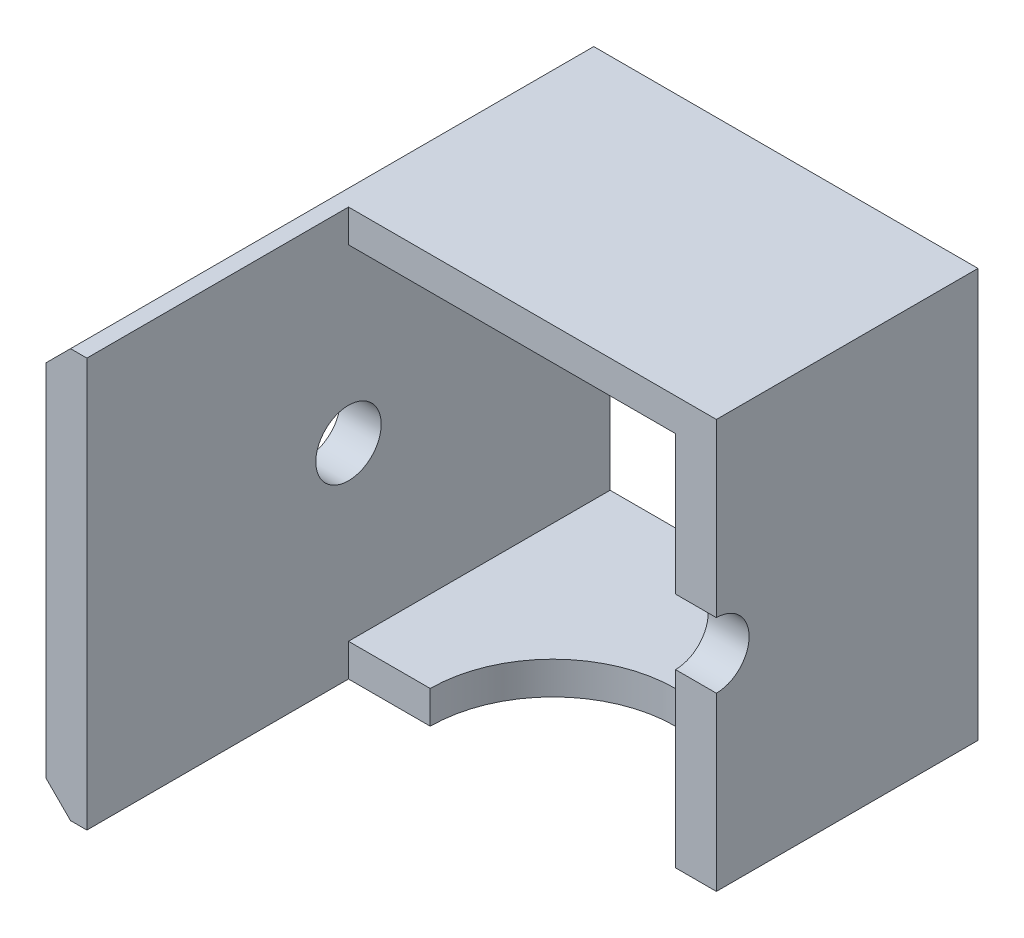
ISO-10303-21;
HEADER;
FILE_DESCRIPTION(('STEP AP214'),'2;1');
FILE_NAME('part.step','',(''),(''),'','','');
FILE_SCHEMA(('AUTOMOTIVE_DESIGN { 1 0 10303 214 1 1 1 1 }'));
ENDSEC;
DATA;
#1=APPLICATION_CONTEXT('core data for automotive mechanical design processes');
#2=APPLICATION_PROTOCOL_DEFINITION('international standard','automotive_design',2000,#1);
#3=PRODUCT_CONTEXT('',#1,'mechanical');
#4=PRODUCT('Part','Part','',(#3));
#5=PRODUCT_RELATED_PRODUCT_CATEGORY('part','',(#4));
#6=PRODUCT_DEFINITION_FORMATION('','',#4);
#7=PRODUCT_DEFINITION_CONTEXT('part definition',#1,'design');
#8=PRODUCT_DEFINITION('design','',#6,#7);
#9=PRODUCT_DEFINITION_SHAPE('','',#8);
#10=(LENGTH_UNIT() NAMED_UNIT(*) SI_UNIT(.MILLI.,.METRE.));
#11=(NAMED_UNIT(*) PLANE_ANGLE_UNIT() SI_UNIT($,.RADIAN.));
#12=(NAMED_UNIT(*) SI_UNIT($,.STERADIAN.) SOLID_ANGLE_UNIT());
#13=UNCERTAINTY_MEASURE_WITH_UNIT(LENGTH_MEASURE(1.E-05),#10,'distance_accuracy_value','');
#14=(GEOMETRIC_REPRESENTATION_CONTEXT(3) GLOBAL_UNCERTAINTY_ASSIGNED_CONTEXT((#13)) GLOBAL_UNIT_ASSIGNED_CONTEXT((#10,
#11,#12)) REPRESENTATION_CONTEXT('',''));
#15=CARTESIAN_POINT('',(0.,0.,0.));
#16=DIRECTION('',(0.,0.,1.));
#17=DIRECTION('',(1.,0.,0.));
#18=AXIS2_PLACEMENT_3D('',#15,#16,#17);
#19=CARTESIAN_POINT('',(-15.,12.5,16.));
#20=DIRECTION('',(0.,0.,1.));
#21=DIRECTION('',(1.,0.,0.));
#22=AXIS2_PLACEMENT_3D('',#19,#20,#21);
#23=PLANE('',#22);
#24=DIRECTION('',(0.,-1.,0.));
#25=VECTOR('',#24,1.);
#26=CARTESIAN_POINT('',(-12.5,10.5,16.));
#27=LINE('',#26,#25);
#28=CARTESIAN_POINT('',(-12.5,12.5,16.));
#29=VERTEX_POINT('',#28);
#30=CARTESIAN_POINT('',(-12.5,-12.5,16.));
#31=VERTEX_POINT('',#30);
#32=EDGE_CURVE('E225',#29,#31,#27,.T.);
#33=ORIENTED_EDGE('',*,*,#32,.F.);
#34=DIRECTION('',(-1.,0.,0.));
#35=VECTOR('',#34,1.);
#36=CARTESIAN_POINT('',(-15.,12.5,16.));
#37=LINE('',#36,#35);
#38=CARTESIAN_POINT('',(-13.5,12.5,16.));
#39=VERTEX_POINT('',#38);
#40=EDGE_CURVE('E170',#29,#39,#37,.T.);
#41=ORIENTED_EDGE('',*,*,#40,.T.);
#42=DIRECTION('',(0.707106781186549,0.707106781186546,0.));
#43=VECTOR('',#42,1.);
#44=CARTESIAN_POINT('',(-14.25,11.75,16.));
#45=LINE('',#44,#43);
#46=CARTESIAN_POINT('',(-15.,11.,16.));
#47=VERTEX_POINT('',#46);
#48=EDGE_CURVE('E193',#39,#47,#45,.F.);
#49=ORIENTED_EDGE('',*,*,#48,.T.);
#50=DIRECTION('',(0.,-1.,0.));
#51=VECTOR('',#50,1.);
#52=CARTESIAN_POINT('',(-15.,12.5,16.));
#53=LINE('',#52,#51);
#54=CARTESIAN_POINT('',(-15.,-11.,16.));
#55=VERTEX_POINT('',#54);
#56=EDGE_CURVE('E247',#47,#55,#53,.T.);
#57=ORIENTED_EDGE('',*,*,#56,.T.);
#58=DIRECTION('',(-0.707106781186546,0.707106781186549,0.));
#59=VECTOR('',#58,1.);
#60=CARTESIAN_POINT('',(-26.75,0.750000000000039,16.));
#61=LINE('',#60,#59);
#62=CARTESIAN_POINT('',(-13.5,-12.5,16.));
#63=VERTEX_POINT('',#62);
#64=EDGE_CURVE('E191',#55,#63,#61,.F.);
#65=ORIENTED_EDGE('',*,*,#64,.T.);
#66=DIRECTION('',(1.,0.,0.));
#67=VECTOR('',#66,1.);
#68=CARTESIAN_POINT('',(-15.,-12.5,16.));
#69=LINE('',#68,#67);
#70=EDGE_CURVE('E174',#63,#31,#69,.T.);
#71=ORIENTED_EDGE('',*,*,#70,.T.);
#72=EDGE_LOOP('',(#33,#41,#49,#57,#65,#71));
#73=FACE_BOUND('',#72,.T.);
#74=ADVANCED_FACE('F35',(#73),#23,.T.);
#75=CARTESIAN_POINT('',(-15.,12.5,-16.));
#76=DIRECTION('',(0.,0.,1.));
#77=DIRECTION('',(1.,0.,0.));
#78=AXIS2_PLACEMENT_3D('',#75,#76,#77);
#79=PLANE('',#78);
#80=DIRECTION('',(0.,-1.,0.));
#81=VECTOR('',#80,1.);
#82=CARTESIAN_POINT('',(-15.,12.5,-16.));
#83=LINE('',#82,#81);
#84=CARTESIAN_POINT('',(-15.,11.,-16.));
#85=VERTEX_POINT('',#84);
#86=CARTESIAN_POINT('',(-15.,-11.,-16.));
#87=VERTEX_POINT('',#86);
#88=EDGE_CURVE('E246',#85,#87,#83,.T.);
#89=ORIENTED_EDGE('',*,*,#88,.F.);
#90=DIRECTION('',(-0.707106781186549,-0.707106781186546,0.));
#91=VECTOR('',#90,1.);
#92=CARTESIAN_POINT('',(-15.,11.,-16.));
#93=LINE('',#92,#91);
#94=CARTESIAN_POINT('',(-13.5,12.5,-16.));
#95=VERTEX_POINT('',#94);
#96=EDGE_CURVE('E186',#85,#95,#93,.F.);
#97=ORIENTED_EDGE('',*,*,#96,.T.);
#98=DIRECTION('',(-1.,0.,0.));
#99=VECTOR('',#98,1.);
#100=CARTESIAN_POINT('',(-15.,12.5,-16.));
#101=LINE('',#100,#99);
#102=CARTESIAN_POINT('',(10.,12.5,-16.));
#103=VERTEX_POINT('',#102);
#104=EDGE_CURVE('E177',#103,#95,#101,.T.);
#105=ORIENTED_EDGE('',*,*,#104,.F.);
#106=DIRECTION('',(0.,1.,0.));
#107=VECTOR('',#106,1.);
#108=CARTESIAN_POINT('',(10.,12.5,-16.));
#109=LINE('',#108,#107);
#110=CARTESIAN_POINT('',(10.,-12.5,-16.));
#111=VERTEX_POINT('',#110);
#112=EDGE_CURVE('E167',#111,#103,#109,.T.);
#113=ORIENTED_EDGE('',*,*,#112,.F.);
#114=DIRECTION('',(1.,0.,0.));
#115=VECTOR('',#114,1.);
#116=CARTESIAN_POINT('',(-15.,-12.5,-16.));
#117=LINE('',#116,#115);
#118=CARTESIAN_POINT('',(-13.5,-12.5,-16.));
#119=VERTEX_POINT('',#118);
#120=EDGE_CURVE('E254',#119,#111,#117,.T.);
#121=ORIENTED_EDGE('',*,*,#120,.F.);
#122=DIRECTION('',(0.707106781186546,-0.707106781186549,0.));
#123=VECTOR('',#122,1.);
#124=CARTESIAN_POINT('',(-13.5,-12.5,-16.));
#125=LINE('',#124,#123);
#126=EDGE_CURVE('E184',#119,#87,#125,.F.);
#127=ORIENTED_EDGE('',*,*,#126,.T.);
#128=EDGE_LOOP('',(#89,#97,#105,#113,#121,#127));
#129=FACE_BOUND('',#128,.T.);
#130=DIRECTION('',(0.,-1.,0.));
#131=VECTOR('',#130,1.);
#132=CARTESIAN_POINT('',(-12.5,10.5,-16.));
#133=LINE('',#132,#131);
#134=CARTESIAN_POINT('',(-12.5,10.5,-16.));
#135=VERTEX_POINT('',#134);
#136=CARTESIAN_POINT('',(-12.5,-10.5,-16.));
#137=VERTEX_POINT('',#136);
#138=EDGE_CURVE('E224',#135,#137,#133,.T.);
#139=ORIENTED_EDGE('',*,*,#138,.T.);
#140=DIRECTION('',(1.,0.,0.));
#141=VECTOR('',#140,1.);
#142=CARTESIAN_POINT('',(-12.5,-10.5,-16.));
#143=LINE('',#142,#141);
#144=CARTESIAN_POINT('',(7.5,-10.5,-16.));
#145=VERTEX_POINT('',#144);
#146=EDGE_CURVE('E231',#137,#145,#143,.T.);
#147=ORIENTED_EDGE('',*,*,#146,.T.);
#148=DIRECTION('',(0.,1.,0.));
#149=VECTOR('',#148,1.);
#150=CARTESIAN_POINT('',(7.5,10.5,-16.));
#151=LINE('',#150,#149);
#152=CARTESIAN_POINT('',(7.5,10.5,-16.));
#153=VERTEX_POINT('',#152);
#154=EDGE_CURVE('E234',#145,#153,#151,.T.);
#155=ORIENTED_EDGE('',*,*,#154,.T.);
#156=DIRECTION('',(-1.,0.,0.));
#157=VECTOR('',#156,1.);
#158=CARTESIAN_POINT('',(-12.5,10.5,-16.));
#159=LINE('',#158,#157);
#160=EDGE_CURVE('E228',#153,#135,#159,.T.);
#161=ORIENTED_EDGE('',*,*,#160,.T.);
#162=EDGE_LOOP('',(#139,#147,#155,#161));
#163=FACE_BOUND('',#162,.T.);
#164=ADVANCED_FACE('F314',(#129,#163),#79,.F.);
#165=CARTESIAN_POINT('',(-15.,12.5,16.));
#166=DIRECTION('',(1.,0.,0.));
#167=DIRECTION('',(0.,0.,-1.));
#168=AXIS2_PLACEMENT_3D('',#165,#166,#167);
#169=PLANE('',#168);
#170=CARTESIAN_POINT('',(-15.,0.,0.));
#171=DIRECTION('',(1.,0.,0.));
#172=DIRECTION('',(0.,0.,-1.));
#173=AXIS2_PLACEMENT_3D('',#170,#171,#172);
#174=CIRCLE('',#173,2.);
#175=CARTESIAN_POINT('',(-15.,0.,-2.));
#176=VERTEX_POINT('',#175);
#177=EDGE_CURVE('E201',#176,#176,#174,.T.);
#178=ORIENTED_EDGE('',*,*,#177,.T.);
#179=EDGE_LOOP('',(#178));
#180=FACE_BOUND('',#179,.T.);
#181=ORIENTED_EDGE('',*,*,#56,.F.);
#182=DIRECTION('',(0.,0.,-1.));
#183=VECTOR('',#182,1.);
#184=CARTESIAN_POINT('',(-15.,11.,16.));
#185=LINE('',#184,#183);
#186=EDGE_CURVE('E181',#47,#85,#185,.T.);
#187=ORIENTED_EDGE('',*,*,#186,.T.);
#188=ORIENTED_EDGE('',*,*,#88,.T.);
#189=DIRECTION('',(0.,0.,1.));
#190=VECTOR('',#189,1.);
#191=CARTESIAN_POINT('',(-15.,-11.,16.));
#192=LINE('',#191,#190);
#193=EDGE_CURVE('E172',#87,#55,#192,.T.);
#194=ORIENTED_EDGE('',*,*,#193,.T.);
#195=EDGE_LOOP('',(#181,#187,#188,#194));
#196=FACE_BOUND('',#195,.T.);
#197=ADVANCED_FACE('F266',(#180,#196),#169,.F.);
#198=CARTESIAN_POINT('',(-15.,-12.5,16.));
#199=DIRECTION('',(0.,1.,0.));
#200=DIRECTION('',(-1.,0.,0.));
#201=AXIS2_PLACEMENT_3D('',#198,#199,#200);
#202=PLANE('',#201);
#203=DIRECTION('',(0.,0.,-1.));
#204=VECTOR('',#203,1.);
#205=CARTESIAN_POINT('',(10.,-12.5,16.));
#206=LINE('',#205,#204);
#207=CARTESIAN_POINT('',(10.,-12.5,0.));
#208=VERTEX_POINT('',#207);
#209=EDGE_CURVE('E169',#208,#111,#206,.T.);
#210=ORIENTED_EDGE('',*,*,#209,.F.);
#211=DIRECTION('',(1.,0.,0.));
#212=VECTOR('',#211,1.);
#213=CARTESIAN_POINT('',(10.,-12.5,0.));
#214=LINE('',#213,#212);
#215=CARTESIAN_POINT('',(7.5,-12.5,0.));
#216=VERTEX_POINT('',#215);
#217=EDGE_CURVE('E285',#216,#208,#214,.T.);
#218=ORIENTED_EDGE('',*,*,#217,.F.);
#219=CARTESIAN_POINT('',(0.,-12.5,0.));
#220=DIRECTION('',(0.,-1.,0.));
#221=DIRECTION('',(1.,0.,0.));
#222=AXIS2_PLACEMENT_3D('',#219,#220,#221);
#223=CIRCLE('',#222,7.5);
#224=CARTESIAN_POINT('',(-7.5,-12.5,0.));
#225=VERTEX_POINT('',#224);
#226=EDGE_CURVE('E221',#225,#216,#223,.T.);
#227=ORIENTED_EDGE('',*,*,#226,.F.);
#228=CARTESIAN_POINT('',(-12.5,-12.5,0.));
#229=VERTEX_POINT('',#228);
#230=EDGE_CURVE('E50',#229,#225,#214,.T.);
#231=ORIENTED_EDGE('',*,*,#230,.F.);
#232=DIRECTION('',(0.,0.,-1.));
#233=VECTOR('',#232,1.);
#234=CARTESIAN_POINT('',(-12.5,-12.5,16.));
#235=LINE('',#234,#233);
#236=EDGE_CURVE('E276',#31,#229,#235,.T.);
#237=ORIENTED_EDGE('',*,*,#236,.F.);
#238=ORIENTED_EDGE('',*,*,#70,.F.);
#239=DIRECTION('',(0.,0.,-1.));
#240=VECTOR('',#239,1.);
#241=CARTESIAN_POINT('',(-13.5,-12.5,16.));
#242=LINE('',#241,#240);
#243=EDGE_CURVE('E195',#63,#119,#242,.T.);
#244=ORIENTED_EDGE('',*,*,#243,.T.);
#245=ORIENTED_EDGE('',*,*,#120,.T.);
#246=EDGE_LOOP('',(#210,#218,#227,#231,#237,#238,#244,#245));
#247=FACE_BOUND('',#246,.T.);
#248=ADVANCED_FACE('F274',(#247),#202,.F.);
#249=CARTESIAN_POINT('',(10.,12.5,16.));
#250=DIRECTION('',(-1.,0.,0.));
#251=DIRECTION('',(0.,0.,1.));
#252=AXIS2_PLACEMENT_3D('',#249,#250,#251);
#253=PLANE('',#252);
#254=DIRECTION('',(0.,0.,-1.));
#255=VECTOR('',#254,1.);
#256=CARTESIAN_POINT('',(10.,12.5,16.));
#257=LINE('',#256,#255);
#258=CARTESIAN_POINT('',(10.,12.5,0.));
#259=VERTEX_POINT('',#258);
#260=EDGE_CURVE('E161',#259,#103,#257,.T.);
#261=ORIENTED_EDGE('',*,*,#260,.F.);
#262=DIRECTION('',(0.,1.,0.));
#263=VECTOR('',#262,1.);
#264=CARTESIAN_POINT('',(10.,-40.108875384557,0.));
#265=LINE('',#264,#263);
#266=CARTESIAN_POINT('',(10.,2.,0.));
#267=VERTEX_POINT('',#266);
#268=EDGE_CURVE('E146',#267,#259,#265,.T.);
#269=ORIENTED_EDGE('',*,*,#268,.F.);
#270=CARTESIAN_POINT('',(10.,0.,0.));
#271=DIRECTION('',(1.,0.,0.));
#272=DIRECTION('',(0.,0.,-1.));
#273=AXIS2_PLACEMENT_3D('',#270,#271,#272);
#274=CIRCLE('',#273,2.);
#275=CARTESIAN_POINT('',(10.,-2.,0.));
#276=VERTEX_POINT('',#275);
#277=EDGE_CURVE('E204',#276,#267,#274,.T.);
#278=ORIENTED_EDGE('',*,*,#277,.F.);
#279=EDGE_CURVE('E58',#208,#276,#265,.T.);
#280=ORIENTED_EDGE('',*,*,#279,.F.);
#281=ORIENTED_EDGE('',*,*,#209,.T.);
#282=ORIENTED_EDGE('',*,*,#112,.T.);
#283=EDGE_LOOP('',(#261,#269,#278,#280,#281,#282));
#284=FACE_BOUND('',#283,.T.);
#285=ADVANCED_FACE('F165',(#284),#253,.F.);
#286=CARTESIAN_POINT('',(-15.,12.5,16.));
#287=DIRECTION('',(0.,-1.,0.));
#288=DIRECTION('',(1.,0.,0.));
#289=AXIS2_PLACEMENT_3D('',#286,#287,#288);
#290=PLANE('',#289);
#291=ORIENTED_EDGE('',*,*,#40,.F.);
#292=DIRECTION('',(0.,0.,1.));
#293=VECTOR('',#292,1.);
#294=CARTESIAN_POINT('',(-12.5,12.5,16.));
#295=LINE('',#294,#293);
#296=CARTESIAN_POINT('',(-12.5,12.5,0.));
#297=VERTEX_POINT('',#296);
#298=EDGE_CURVE('E155',#297,#29,#295,.T.);
#299=ORIENTED_EDGE('',*,*,#298,.F.);
#300=DIRECTION('',(-1.,0.,0.));
#301=VECTOR('',#300,1.);
#302=CARTESIAN_POINT('',(10.,12.5,0.));
#303=LINE('',#302,#301);
#304=EDGE_CURVE('E149',#259,#297,#303,.T.);
#305=ORIENTED_EDGE('',*,*,#304,.F.);
#306=ORIENTED_EDGE('',*,*,#260,.T.);
#307=ORIENTED_EDGE('',*,*,#104,.T.);
#308=DIRECTION('',(0.,0.,1.));
#309=VECTOR('',#308,1.);
#310=CARTESIAN_POINT('',(-13.5,12.5,16.));
#311=LINE('',#310,#309);
#312=EDGE_CURVE('E188',#95,#39,#311,.T.);
#313=ORIENTED_EDGE('',*,*,#312,.T.);
#314=EDGE_LOOP('',(#291,#299,#305,#306,#307,#313));
#315=FACE_BOUND('',#314,.T.);
#316=ADVANCED_FACE('F159',(#315),#290,.F.);
#317=CARTESIAN_POINT('',(-12.5,10.5,16.));
#318=DIRECTION('',(1.,0.,0.));
#319=DIRECTION('',(0.,0.,-1.));
#320=AXIS2_PLACEMENT_3D('',#317,#318,#319);
#321=PLANE('',#320);
#322=CARTESIAN_POINT('',(-12.5,0.,0.));
#323=DIRECTION('',(1.,0.,0.));
#324=DIRECTION('',(0.,0.,-1.));
#325=AXIS2_PLACEMENT_3D('',#322,#323,#324);
#326=CIRCLE('',#325,2.);
#327=CARTESIAN_POINT('',(-12.5,0.,-2.));
#328=VERTEX_POINT('',#327);
#329=EDGE_CURVE('E200',#328,#328,#326,.T.);
#330=ORIENTED_EDGE('',*,*,#329,.F.);
#331=EDGE_LOOP('',(#330));
#332=FACE_BOUND('',#331,.T.);
#333=DIRECTION('',(0.,1.,0.));
#334=VECTOR('',#333,1.);
#335=CARTESIAN_POINT('',(-12.5,-40.108875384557,0.));
#336=LINE('',#335,#334);
#337=CARTESIAN_POINT('',(-12.5,-10.5,0.));
#338=VERTEX_POINT('',#337);
#339=EDGE_CURVE('E289',#229,#338,#336,.T.);
#340=ORIENTED_EDGE('',*,*,#339,.T.);
#341=DIRECTION('',(0.,0.,-1.));
#342=VECTOR('',#341,1.);
#343=CARTESIAN_POINT('',(-12.5,-10.5,16.));
#344=LINE('',#343,#342);
#345=EDGE_CURVE('E244',#338,#137,#344,.T.);
#346=ORIENTED_EDGE('',*,*,#345,.T.);
#347=ORIENTED_EDGE('',*,*,#138,.F.);
#348=DIRECTION('',(0.,0.,-1.));
#349=VECTOR('',#348,1.);
#350=CARTESIAN_POINT('',(-12.5,10.5,16.));
#351=LINE('',#350,#349);
#352=CARTESIAN_POINT('',(-12.5,10.5,0.));
#353=VERTEX_POINT('',#352);
#354=EDGE_CURVE('E227',#353,#135,#351,.T.);
#355=ORIENTED_EDGE('',*,*,#354,.F.);
#356=EDGE_CURVE('E290',#353,#297,#336,.T.);
#357=ORIENTED_EDGE('',*,*,#356,.T.);
#358=ORIENTED_EDGE('',*,*,#298,.T.);
#359=ORIENTED_EDGE('',*,*,#32,.T.);
#360=ORIENTED_EDGE('',*,*,#236,.T.);
#361=EDGE_LOOP('',(#340,#346,#347,#355,#357,#358,#359,#360));
#362=FACE_BOUND('',#361,.T.);
#363=ADVANCED_FACE('F316',(#332,#362),#321,.T.);
#364=CARTESIAN_POINT('',(-12.5,-10.5,16.));
#365=DIRECTION('',(0.,1.,0.));
#366=DIRECTION('',(-1.,0.,0.));
#367=AXIS2_PLACEMENT_3D('',#364,#365,#366);
#368=PLANE('',#367);
#369=DIRECTION('',(-1.,0.,0.));
#370=VECTOR('',#369,1.);
#371=CARTESIAN_POINT('',(-12.5,-10.5,0.));
#372=LINE('',#371,#370);
#373=CARTESIAN_POINT('',(-7.5,-10.5,0.));
#374=VERTEX_POINT('',#373);
#375=EDGE_CURVE('E208',#374,#338,#372,.T.);
#376=ORIENTED_EDGE('',*,*,#375,.F.);
#377=CARTESIAN_POINT('',(0.,-10.5,0.));
#378=DIRECTION('',(0.,1.,0.));
#379=DIRECTION('',(-1.,0.,0.));
#380=AXIS2_PLACEMENT_3D('',#377,#378,#379);
#381=CIRCLE('',#380,7.5);
#382=CARTESIAN_POINT('',(7.5,-10.5,0.));
#383=VERTEX_POINT('',#382);
#384=EDGE_CURVE('E218',#374,#383,#381,.F.);
#385=ORIENTED_EDGE('',*,*,#384,.T.);
#386=DIRECTION('',(0.,0.,-1.));
#387=VECTOR('',#386,1.);
#388=CARTESIAN_POINT('',(7.5,-10.5,16.));
#389=LINE('',#388,#387);
#390=EDGE_CURVE('E242',#383,#145,#389,.T.);
#391=ORIENTED_EDGE('',*,*,#390,.T.);
#392=ORIENTED_EDGE('',*,*,#146,.F.);
#393=ORIENTED_EDGE('',*,*,#345,.F.);
#394=EDGE_LOOP('',(#376,#385,#391,#392,#393));
#395=FACE_BOUND('',#394,.T.);
#396=ADVANCED_FACE('F304',(#395),#368,.T.);
#397=CARTESIAN_POINT('',(7.5,10.5,16.));
#398=DIRECTION('',(-1.,0.,0.));
#399=DIRECTION('',(0.,0.,1.));
#400=AXIS2_PLACEMENT_3D('',#397,#398,#399);
#401=PLANE('',#400);
#402=DIRECTION('',(0.,-1.,0.));
#403=VECTOR('',#402,1.);
#404=CARTESIAN_POINT('',(7.5,10.5,0.));
#405=LINE('',#404,#403);
#406=CARTESIAN_POINT('',(7.5,10.5,0.));
#407=VERTEX_POINT('',#406);
#408=CARTESIAN_POINT('',(7.5,2.,0.));
#409=VERTEX_POINT('',#408);
#410=EDGE_CURVE('E284',#407,#409,#405,.T.);
#411=ORIENTED_EDGE('',*,*,#410,.F.);
#412=DIRECTION('',(0.,0.,-1.));
#413=VECTOR('',#412,1.);
#414=CARTESIAN_POINT('',(7.5,10.5,16.));
#415=LINE('',#414,#413);
#416=EDGE_CURVE('E240',#407,#153,#415,.T.);
#417=ORIENTED_EDGE('',*,*,#416,.T.);
#418=ORIENTED_EDGE('',*,*,#154,.F.);
#419=ORIENTED_EDGE('',*,*,#390,.F.);
#420=CARTESIAN_POINT('',(7.50000000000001,-2.,0.));
#421=VERTEX_POINT('',#420);
#422=EDGE_CURVE('E280',#421,#383,#405,.T.);
#423=ORIENTED_EDGE('',*,*,#422,.F.);
#424=CARTESIAN_POINT('',(7.5,0.,0.));
#425=DIRECTION('',(-1.,0.,0.));
#426=DIRECTION('',(0.,0.,1.));
#427=AXIS2_PLACEMENT_3D('',#424,#425,#426);
#428=CIRCLE('',#427,2.);
#429=EDGE_CURVE('E198',#409,#421,#428,.T.);
#430=ORIENTED_EDGE('',*,*,#429,.F.);
#431=EDGE_LOOP('',(#411,#417,#418,#419,#423,#430));
#432=FACE_BOUND('',#431,.T.);
#433=ADVANCED_FACE('F310',(#432),#401,.T.);
#434=CARTESIAN_POINT('',(-12.5,10.5,16.));
#435=DIRECTION('',(0.,-1.,0.));
#436=DIRECTION('',(1.,0.,0.));
#437=AXIS2_PLACEMENT_3D('',#434,#435,#436);
#438=PLANE('',#437);
#439=DIRECTION('',(1.,0.,0.));
#440=VECTOR('',#439,1.);
#441=CARTESIAN_POINT('',(-12.5,10.5,0.));
#442=LINE('',#441,#440);
#443=EDGE_CURVE('E294',#353,#407,#442,.T.);
#444=ORIENTED_EDGE('',*,*,#443,.F.);
#445=ORIENTED_EDGE('',*,*,#354,.T.);
#446=ORIENTED_EDGE('',*,*,#160,.F.);
#447=ORIENTED_EDGE('',*,*,#416,.F.);
#448=EDGE_LOOP('',(#444,#445,#446,#447));
#449=FACE_BOUND('',#448,.T.);
#450=ADVANCED_FACE('F345',(#449),#438,.T.);
#451=CARTESIAN_POINT('',(-15.,11.,16.));
#452=DIRECTION('',(0.707106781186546,-0.707106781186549,0.));
#453=DIRECTION('',(0.707106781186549,0.707106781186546,0.));
#454=AXIS2_PLACEMENT_3D('',#451,#452,#453);
#455=PLANE('',#454);
#456=ORIENTED_EDGE('',*,*,#48,.F.);
#457=ORIENTED_EDGE('',*,*,#312,.F.);
#458=ORIENTED_EDGE('',*,*,#96,.F.);
#459=ORIENTED_EDGE('',*,*,#186,.F.);
#460=EDGE_LOOP('',(#456,#457,#458,#459));
#461=FACE_BOUND('',#460,.T.);
#462=ADVANCED_FACE('F260',(#461),#455,.F.);
#463=CARTESIAN_POINT('',(-13.5,-12.5,16.));
#464=DIRECTION('',(0.707106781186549,0.707106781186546,0.));
#465=DIRECTION('',(-0.707106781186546,0.707106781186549,0.));
#466=AXIS2_PLACEMENT_3D('',#463,#464,#465);
#467=PLANE('',#466);
#468=ORIENTED_EDGE('',*,*,#64,.F.);
#469=ORIENTED_EDGE('',*,*,#193,.F.);
#470=ORIENTED_EDGE('',*,*,#126,.F.);
#471=ORIENTED_EDGE('',*,*,#243,.F.);
#472=EDGE_LOOP('',(#468,#469,#470,#471));
#473=FACE_BOUND('',#472,.T.);
#474=ADVANCED_FACE('F37',(#473),#467,.F.);
#475=CARTESIAN_POINT('',(0.,12.501,0.));
#476=DIRECTION('',(0.,-1.,0.));
#477=DIRECTION('',(1.,0.,0.));
#478=AXIS2_PLACEMENT_3D('',#475,#476,#477);
#479=CYLINDRICAL_SURFACE('',#478,7.5);
#480=ORIENTED_EDGE('',*,*,#226,.T.);
#481=DIRECTION('',(0.,-1.,0.));
#482=VECTOR('',#481,1.);
#483=CARTESIAN_POINT('',(7.5,12.501,0.));
#484=LINE('',#483,#482);
#485=EDGE_CURVE('E282',#216,#383,#484,.F.);
#486=ORIENTED_EDGE('',*,*,#485,.T.);
#487=ORIENTED_EDGE('',*,*,#384,.F.);
#488=DIRECTION('',(0.,-1.,0.));
#489=VECTOR('',#488,1.);
#490=CARTESIAN_POINT('',(-7.5,12.501,0.));
#491=LINE('',#490,#489);
#492=EDGE_CURVE('E212',#374,#225,#491,.T.);
#493=ORIENTED_EDGE('',*,*,#492,.T.);
#494=EDGE_LOOP('',(#480,#486,#487,#493));
#495=FACE_BOUND('',#494,.T.);
#496=ADVANCED_FACE('F298',(#495),#479,.F.);
#497=CARTESIAN_POINT('',(-15.,0.,0.));
#498=DIRECTION('',(1.,0.,0.));
#499=DIRECTION('',(0.,0.,-1.));
#500=AXIS2_PLACEMENT_3D('',#497,#498,#499);
#501=CYLINDRICAL_SURFACE('',#500,2.);
#502=ORIENTED_EDGE('',*,*,#277,.T.);
#503=DIRECTION('',(1.,0.,0.));
#504=VECTOR('',#503,1.);
#505=CARTESIAN_POINT('',(-15.,2.,0.));
#506=LINE('',#505,#504);
#507=EDGE_CURVE('E11',#267,#409,#506,.F.);
#508=ORIENTED_EDGE('',*,*,#507,.T.);
#509=ORIENTED_EDGE('',*,*,#429,.T.);
#510=DIRECTION('',(1.,0.,0.));
#511=VECTOR('',#510,1.);
#512=CARTESIAN_POINT('',(-15.,-2.,0.));
#513=LINE('',#512,#511);
#514=EDGE_CURVE('E43',#421,#276,#513,.T.);
#515=ORIENTED_EDGE('',*,*,#514,.T.);
#516=EDGE_LOOP('',(#502,#508,#509,#515));
#517=FACE_BOUND('',#516,.T.);
#518=ADVANCED_FACE('F203',(#517),#501,.F.);
#519=ORIENTED_EDGE('',*,*,#329,.T.);
#520=EDGE_LOOP('',(#519));
#521=FACE_BOUND('',#520,.T.);
#522=ORIENTED_EDGE('',*,*,#177,.F.);
#523=EDGE_LOOP('',(#522));
#524=FACE_BOUND('',#523,.T.);
#525=ADVANCED_FACE('F326',(#521,#524),#501,.F.);
#526=CARTESIAN_POINT('',(10.,-40.108875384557,0.));
#527=DIRECTION('',(0.,0.,-1.));
#528=DIRECTION('',(-1.,0.,0.));
#529=AXIS2_PLACEMENT_3D('',#526,#527,#528);
#530=PLANE('',#529);
#531=ORIENTED_EDGE('',*,*,#217,.T.);
#532=ORIENTED_EDGE('',*,*,#279,.T.);
#533=ORIENTED_EDGE('',*,*,#514,.F.);
#534=ORIENTED_EDGE('',*,*,#422,.T.);
#535=ORIENTED_EDGE('',*,*,#485,.F.);
#536=EDGE_LOOP('',(#531,#532,#533,#534,#535));
#537=FACE_BOUND('',#536,.T.);
#538=ADVANCED_FACE('F301',(#537),#530,.F.);
#539=ORIENTED_EDGE('',*,*,#443,.T.);
#540=ORIENTED_EDGE('',*,*,#410,.T.);
#541=ORIENTED_EDGE('',*,*,#507,.F.);
#542=ORIENTED_EDGE('',*,*,#268,.T.);
#543=ORIENTED_EDGE('',*,*,#304,.T.);
#544=ORIENTED_EDGE('',*,*,#356,.F.);
#545=EDGE_LOOP('',(#539,#540,#541,#542,#543,#544));
#546=FACE_BOUND('',#545,.T.);
#547=ADVANCED_FACE('F148',(#546),#530,.F.);
#548=ORIENTED_EDGE('',*,*,#375,.T.);
#549=ORIENTED_EDGE('',*,*,#339,.F.);
#550=ORIENTED_EDGE('',*,*,#230,.T.);
#551=ORIENTED_EDGE('',*,*,#492,.F.);
#552=EDGE_LOOP('',(#548,#549,#550,#551));
#553=FACE_BOUND('',#552,.T.);
#554=ADVANCED_FACE('F318',(#553),#530,.F.);
#555=CLOSED_SHELL('',(#74,#164,#197,#248,#285,#316,#363,#396,#433,#450,#462,#474,#496,#518,#525,
#538,#547,#554));
#556=MANIFOLD_SOLID_BREP('B2',#555);
#557=ADVANCED_BREP_SHAPE_REPRESENTATION('',(#18,#556),#14);
#558=SHAPE_DEFINITION_REPRESENTATION(#9,#557);
ENDSEC;
END-ISO-10303-21;
